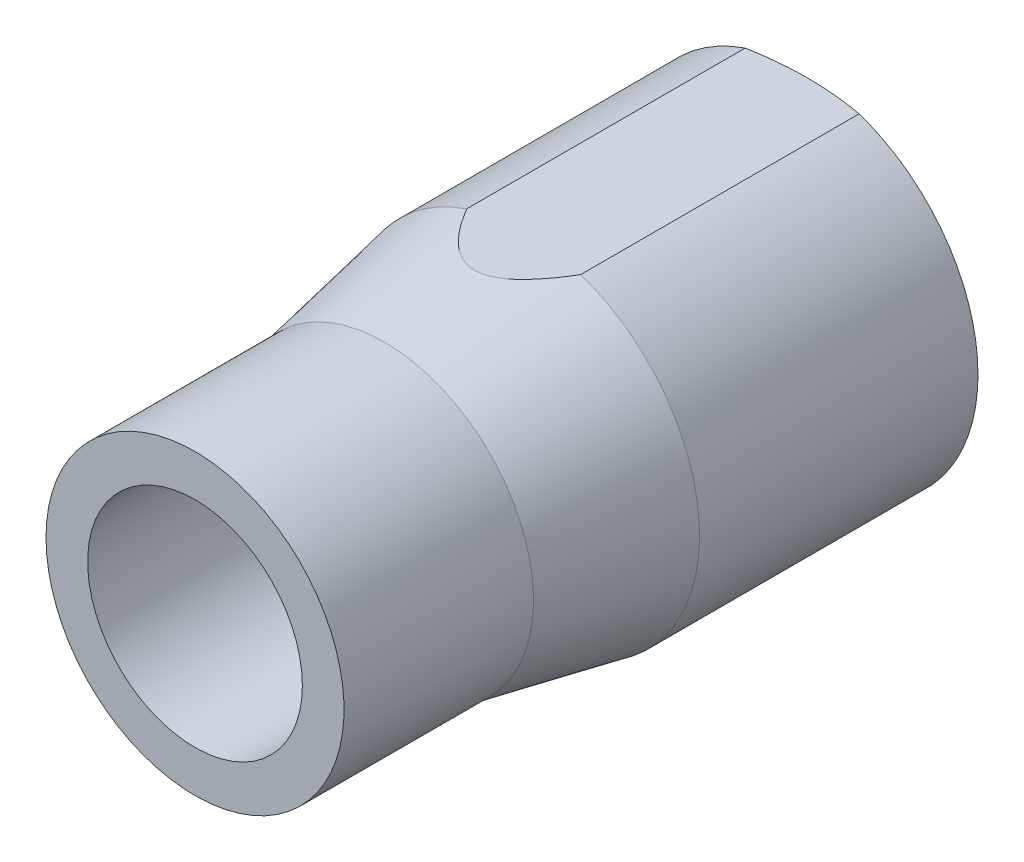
ISO-10303-21;
HEADER;
FILE_DESCRIPTION(('STEP AP214'),'2;1');
FILE_NAME('part.step','',(''),(''),'','','');
FILE_SCHEMA(('AUTOMOTIVE_DESIGN { 1 0 10303 214 1 1 1 1 }'));
ENDSEC;
DATA;
#1=APPLICATION_CONTEXT('core data for automotive mechanical design processes');
#2=APPLICATION_PROTOCOL_DEFINITION('international standard','automotive_design',2000,#1);
#3=PRODUCT_CONTEXT('',#1,'mechanical');
#4=PRODUCT('Part','Part','',(#3));
#5=PRODUCT_RELATED_PRODUCT_CATEGORY('part','',(#4));
#6=PRODUCT_DEFINITION_FORMATION('','',#4);
#7=PRODUCT_DEFINITION_CONTEXT('part definition',#1,'design');
#8=PRODUCT_DEFINITION('design','',#6,#7);
#9=PRODUCT_DEFINITION_SHAPE('','',#8);
#10=(LENGTH_UNIT() NAMED_UNIT(*) SI_UNIT(.MILLI.,.METRE.));
#11=(NAMED_UNIT(*) PLANE_ANGLE_UNIT() SI_UNIT($,.RADIAN.));
#12=(NAMED_UNIT(*) SI_UNIT($,.STERADIAN.) SOLID_ANGLE_UNIT());
#13=UNCERTAINTY_MEASURE_WITH_UNIT(LENGTH_MEASURE(1.E-05),#10,'distance_accuracy_value','');
#14=(GEOMETRIC_REPRESENTATION_CONTEXT(3) GLOBAL_UNCERTAINTY_ASSIGNED_CONTEXT((#13)) GLOBAL_UNIT_ASSIGNED_CONTEXT((#10,
#11,#12)) REPRESENTATION_CONTEXT('',''));
#15=CARTESIAN_POINT('',(0.,0.,0.));
#16=DIRECTION('',(0.,0.,1.));
#17=DIRECTION('',(1.,0.,0.));
#18=AXIS2_PLACEMENT_3D('',#15,#16,#17);
#19=CARTESIAN_POINT('',(0.,0.,13.7795));
#20=DIRECTION('',(0.,0.,-1.));
#21=DIRECTION('',(-1.,0.,0.));
#22=AXIS2_PLACEMENT_3D('',#19,#20,#21);
#23=CYLINDRICAL_SURFACE('',#22,2.06985324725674);
#24=CARTESIAN_POINT('',(0.,0.,0.));
#25=DIRECTION('',(0.,0.,-1.));
#26=DIRECTION('',(-1.,0.,0.));
#27=AXIS2_PLACEMENT_3D('',#24,#25,#26);
#28=CIRCLE('',#27,2.06985324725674);
#29=CARTESIAN_POINT('',(-2.06985324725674,0.,0.));
#30=VERTEX_POINT('',#29);
#31=EDGE_CURVE('E170',#30,#30,#28,.T.);
#32=ORIENTED_EDGE('',*,*,#31,.T.);
#33=EDGE_LOOP('',(#32));
#34=FACE_BOUND('',#33,.T.);
#35=CARTESIAN_POINT('',(0.,0.,11.3284));
#36=DIRECTION('',(0.,0.,1.));
#37=DIRECTION('',(1.,0.,0.));
#38=AXIS2_PLACEMENT_3D('',#35,#36,#37);
#39=CIRCLE('',#38,2.06985324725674);
#40=CARTESIAN_POINT('',(2.06985324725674,0.,11.3284));
#41=VERTEX_POINT('',#40);
#42=EDGE_CURVE('E42',#41,#41,#39,.F.);
#43=ORIENTED_EDGE('',*,*,#42,.F.);
#44=EDGE_LOOP('',(#43));
#45=FACE_BOUND('',#44,.T.);
#46=ADVANCED_FACE('F37',(#34,#45),#23,.F.);
#47=CARTESIAN_POINT('',(0.,0.,9.7155));
#48=DIRECTION('',(0.,0.,-1.));
#49=DIRECTION('',(-1.,0.,0.));
#50=AXIS2_PLACEMENT_3D('',#47,#48,#49);
#51=CYLINDRICAL_SURFACE('',#50,5.2451);
#52=DIRECTION('',(0.,0.,-1.));
#53=VECTOR('',#52,1.);
#54=CARTESIAN_POINT('',(1.69954716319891,4.96211783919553,9.7155));
#55=LINE('',#54,#53);
#56=CARTESIAN_POINT('',(1.69954716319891,4.96211783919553,9.7155));
#57=VERTEX_POINT('',#56);
#58=CARTESIAN_POINT('',(1.69954716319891,4.96211783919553,1.40794499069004));
#59=VERTEX_POINT('',#58);
#60=EDGE_CURVE('E162',#57,#59,#55,.T.);
#61=ORIENTED_EDGE('',*,*,#60,.F.);
#62=CARTESIAN_POINT('',(0.,0.,9.7155));
#63=DIRECTION('',(0.,0.,-1.));
#64=DIRECTION('',(-1.,0.,0.));
#65=AXIS2_PLACEMENT_3D('',#62,#63,#64);
#66=CIRCLE('',#65,5.2451);
#67=CARTESIAN_POINT('',(1.69954716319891,-4.96211783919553,9.7155));
#68=VERTEX_POINT('',#67);
#69=EDGE_CURVE('E97',#68,#57,#66,.F.);
#70=ORIENTED_EDGE('',*,*,#69,.F.);
#71=DIRECTION('',(0.,0.,-1.));
#72=VECTOR('',#71,1.);
#73=CARTESIAN_POINT('',(1.69954716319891,-4.96211783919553,9.7155));
#74=LINE('',#73,#72);
#75=CARTESIAN_POINT('',(1.69954716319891,-4.96211783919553,1.40794499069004));
#76=VERTEX_POINT('',#75);
#77=EDGE_CURVE('E54',#76,#68,#74,.F.);
#78=ORIENTED_EDGE('',*,*,#77,.F.);
#79=CARTESIAN_POINT('',(0.,0.,1.40794499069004));
#80=DIRECTION('',(0.,0.,1.));
#81=DIRECTION('',(1.,0.,0.));
#82=AXIS2_PLACEMENT_3D('',#79,#80,#81);
#83=CIRCLE('',#82,5.2451);
#84=EDGE_CURVE('E96',#76,#59,#83,.T.);
#85=ORIENTED_EDGE('',*,*,#84,.T.);
#86=EDGE_LOOP('',(#61,#70,#78,#85));
#87=FACE_BOUND('',#86,.T.);
#88=ADVANCED_FACE('F183',(#87),#51,.T.);
#89=DIRECTION('',(0.,0.,-1.));
#90=VECTOR('',#89,1.);
#91=CARTESIAN_POINT('',(-1.69954716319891,4.96211783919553,9.7155));
#92=LINE('',#91,#90);
#93=CARTESIAN_POINT('',(-1.69954716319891,4.96211783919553,1.40794499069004));
#94=VERTEX_POINT('',#93);
#95=CARTESIAN_POINT('',(-1.69954716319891,4.96211783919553,9.7155));
#96=VERTEX_POINT('',#95);
#97=EDGE_CURVE('E62',#94,#96,#92,.F.);
#98=ORIENTED_EDGE('',*,*,#97,.F.);
#99=CARTESIAN_POINT('',(-1.69954716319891,-4.96211783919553,1.40794499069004));
#100=VERTEX_POINT('',#99);
#101=EDGE_CURVE('E92',#94,#100,#83,.T.);
#102=ORIENTED_EDGE('',*,*,#101,.T.);
#103=DIRECTION('',(0.,0.,-1.));
#104=VECTOR('',#103,1.);
#105=CARTESIAN_POINT('',(-1.69954716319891,-4.96211783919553,9.7155));
#106=LINE('',#105,#104);
#107=CARTESIAN_POINT('',(-1.69954716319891,-4.96211783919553,9.7155));
#108=VERTEX_POINT('',#107);
#109=EDGE_CURVE('E78',#108,#100,#106,.T.);
#110=ORIENTED_EDGE('',*,*,#109,.F.);
#111=EDGE_CURVE('E90',#96,#108,#66,.F.);
#112=ORIENTED_EDGE('',*,*,#111,.F.);
#113=EDGE_LOOP('',(#98,#102,#110,#112));
#114=FACE_BOUND('',#113,.T.);
#115=ADVANCED_FACE('F89',(#114),#51,.T.);
#116=CARTESIAN_POINT('',(0.,0.,1.40794499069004));
#117=DIRECTION('',(0.,0.,1.));
#118=DIRECTION('',(1.,0.,0.));
#119=AXIS2_PLACEMENT_3D('',#116,#117,#118);
#120=CONICAL_SURFACE('',#119,5.2451,1.06465084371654);
#121=CARTESIAN_POINT('',(0.,0.,0.));
#122=DIRECTION('',(0.,0.,1.));
#123=DIRECTION('',(1.,0.,0.));
#124=AXIS2_PLACEMENT_3D('',#121,#122,#123);
#125=CIRCLE('',#124,2.70509999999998);
#126=CARTESIAN_POINT('',(2.70509999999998,0.,0.));
#127=VERTEX_POINT('',#126);
#128=EDGE_CURVE('E84',#127,#127,#125,.F.);
#129=ORIENTED_EDGE('',*,*,#128,.F.);
#130=EDGE_LOOP('',(#129));
#131=FACE_BOUND('',#130,.T.);
#132=ORIENTED_EDGE('',*,*,#101,.F.);
#133=CARTESIAN_POINT('',(-7.09579786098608,4.96211783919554,3.30013036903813));
#134=CARTESIAN_POINT('',(-6.88559882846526,4.96211783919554,3.20467618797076));
#135=CARTESIAN_POINT('',(-6.6748884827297,4.96211783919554,3.110325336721));
#136=CARTESIAN_POINT('',(-6.25217843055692,4.96211783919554,2.92445065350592));
#137=CARTESIAN_POINT('',(-6.04017848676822,4.96211783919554,2.832927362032));
#138=CARTESIAN_POINT('',(-5.61342540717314,4.96211783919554,2.65282607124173));
#139=CARTESIAN_POINT('',(-5.39866338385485,4.96211783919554,2.56426904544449));
#140=CARTESIAN_POINT('',(-4.96737319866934,4.96211783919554,2.39158081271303));
#141=CARTESIAN_POINT('',(-4.7508451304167,4.96211783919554,2.30744937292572));
#142=CARTESIAN_POINT('',(-4.31194202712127,4.96211783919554,2.14335496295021));
#143=CARTESIAN_POINT('',(-4.08953054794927,4.96211783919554,2.06348886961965));
#144=CARTESIAN_POINT('',(-3.64216471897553,4.96211783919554,1.91108621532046));
#145=CARTESIAN_POINT('',(-3.41721011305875,4.96211783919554,1.83855040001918));
#146=CARTESIAN_POINT('',(-2.96499915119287,4.96211783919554,1.70297541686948));
#147=CARTESIAN_POINT('',(-2.73774940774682,4.96211783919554,1.63991443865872));
#148=CARTESIAN_POINT('',(-2.28033075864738,4.96211783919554,1.52550762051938));
#149=CARTESIAN_POINT('',(-2.05016251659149,4.96211783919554,1.47415916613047));
#150=CARTESIAN_POINT('',(-1.58327907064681,4.96211783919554,1.38511090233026));
#151=CARTESIAN_POINT('',(-1.3465182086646,4.96211783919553,1.34764563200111));
#152=CARTESIAN_POINT('',(-0.870837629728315,4.96211783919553,1.2901610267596));
#153=CARTESIAN_POINT('',(-0.631917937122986,4.96211783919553,1.27014149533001));
#154=CARTESIAN_POINT('',(-0.155585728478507,4.96211783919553,1.24932127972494));
#155=CARTESIAN_POINT('',(0.0818183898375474,4.96211783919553,1.24833286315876));
#156=CARTESIAN_POINT('',(0.555961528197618,4.96211783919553,1.26518595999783));
#157=CARTESIAN_POINT('',(0.792700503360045,4.96211783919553,1.2830287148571));
#158=CARTESIAN_POINT('',(1.22065762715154,4.96211783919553,1.33115772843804));
#159=CARTESIAN_POINT('',(1.41221476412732,4.96211783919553,1.35854035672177));
#160=CARTESIAN_POINT('',(1.79361048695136,4.96211783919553,1.42352499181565));
#161=CARTESIAN_POINT('',(1.98344871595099,4.96211783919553,1.46112907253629));
#162=CARTESIAN_POINT('',(2.36133958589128,4.96211783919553,1.54512982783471));
#163=CARTESIAN_POINT('',(2.54939030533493,4.96211783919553,1.59153503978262));
#164=CARTESIAN_POINT('',(2.9235041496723,4.96211783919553,1.69167672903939));
#165=CARTESIAN_POINT('',(3.10956734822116,4.96211783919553,1.745412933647));
#166=CARTESIAN_POINT('',(3.4840699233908,4.96211783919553,1.86023956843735));
#167=CARTESIAN_POINT('',(3.67246595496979,4.96211783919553,1.92147037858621));
#168=CARTESIAN_POINT('',(4.04748794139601,4.96211783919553,2.04910671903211));
#169=CARTESIAN_POINT('',(4.23411388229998,4.96211783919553,2.11551229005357));
#170=CARTESIAN_POINT('',(4.6057094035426,4.96211783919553,2.2525163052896));
#171=CARTESIAN_POINT('',(4.79067975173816,4.96211783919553,2.32311267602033));
#172=CARTESIAN_POINT('',(5.15925222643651,4.96211783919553,2.46776408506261));
#173=CARTESIAN_POINT('',(5.34285439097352,4.96211783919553,2.54181902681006));
#174=CARTESIAN_POINT('',(5.72521900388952,4.96211783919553,2.69951629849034));
#175=CARTESIAN_POINT('',(5.92387162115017,4.96211783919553,2.7834243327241));
#176=CARTESIAN_POINT('',(6.31998912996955,4.96211783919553,2.95400277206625));
#177=CARTESIAN_POINT('',(6.51745399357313,4.96211783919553,3.04067324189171));
#178=CARTESIAN_POINT('',(7.10837754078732,4.96211783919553,3.30408419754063));
#179=CARTESIAN_POINT('',(7.50032726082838,4.96211783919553,3.48420835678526));
#180=CARTESIAN_POINT('',(8.28142867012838,4.96211783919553,3.8507457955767));
#181=CARTESIAN_POINT('',(8.67057928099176,4.96211783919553,4.03716135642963));
#182=CARTESIAN_POINT('',(9.44670570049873,4.96211783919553,4.4144767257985));
#183=CARTESIAN_POINT('',(9.83368146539,4.96211783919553,4.60537662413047));
#184=CARTESIAN_POINT('',(10.6065478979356,4.96211783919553,4.99076138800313));
#185=CARTESIAN_POINT('',(10.9924361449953,4.96211783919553,5.18525109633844));
#186=CARTESIAN_POINT('',(11.7629421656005,4.96211783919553,5.57673885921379));
#187=CARTESIAN_POINT('',(12.1475599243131,4.96211783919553,5.77373694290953));
#188=CARTESIAN_POINT('',(12.9157069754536,4.96211783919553,6.16962264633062));
#189=CARTESIAN_POINT('',(13.2992365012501,4.96211783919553,6.36850981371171));
#190=CARTESIAN_POINT('',(14.0655000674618,4.96211783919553,6.76781033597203));
#191=CARTESIAN_POINT('',(14.4482341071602,4.96211783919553,6.96822369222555));
#192=CARTESIAN_POINT('',(15.4996129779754,4.96211783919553,7.52089149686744));
#193=CARTESIAN_POINT('',(16.1676004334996,4.96211783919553,7.87439617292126));
#194=CARTESIAN_POINT('',(17.5022402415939,4.96211783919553,8.58402327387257));
#195=CARTESIAN_POINT('',(18.1688924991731,4.96211783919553,8.94014587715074));
#196=CARTESIAN_POINT('',(19.4993845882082,4.96211783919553,9.65331131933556));
#197=CARTESIAN_POINT('',(20.1632271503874,4.96211783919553,10.0103490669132));
#198=CARTESIAN_POINT('',(21.490088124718,4.96211783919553,10.7258321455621));
#199=CARTESIAN_POINT('',(22.1531065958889,4.96211783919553,11.0842773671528));
#200=CARTESIAN_POINT('',(22.8158545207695,4.96211783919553,11.4432196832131));
#201=B_SPLINE_CURVE_WITH_KNOTS('',3,(#133,#134,#135,#136,#137,#138,#139,#140,#141,#142,#143,
#144,#145,#146,#147,#148,#149,#150,#151,#152,#153,#154,#155,#156,#157,#158,#159,#160,#161,#162,
#163,#164,#165,#166,#167,#168,#169,#170,#171,#172,#173,#174,#175,#176,#177,#178,#179,#180,#181,
#182,#183,#184,#185,#186,#187,#188,#189,#190,#191,#192,#193,#194,#195,#196,#197,#198,#199,#200),
.UNSPECIFIED.,.F.,.F.,(4,2,2,2,2,2,2,2,2,2,2,2,2,2,2,2,2,2,2,2,2,2,2,2,2,2,2,2,2,2,2,2,2,4),(0.,
0.692582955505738,1.38529749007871,2.08216949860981,2.77900480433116,3.48785425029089,
4.19677573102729,4.90403946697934,5.6111451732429,6.32970392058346,7.04825457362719,
7.7597134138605,8.47121916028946,9.05143593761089,9.63177052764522,10.2126709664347,
10.7935498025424,11.38774833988,11.9819515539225,12.5758631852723,13.169758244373,
13.8166716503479,14.4636002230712,15.757580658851,17.0520354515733,18.3465161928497,
19.6428935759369,20.9392860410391,22.235375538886,23.5314662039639,25.7987361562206,
28.06616205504,30.3274574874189,32.5885803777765),.UNSPECIFIED.);
#202=EDGE_CURVE('E164',#94,#59,#201,.T.);
#203=ORIENTED_EDGE('',*,*,#202,.T.);
#204=ORIENTED_EDGE('',*,*,#84,.F.);
#205=CARTESIAN_POINT('',(-7.09579786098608,-4.96211783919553,3.30013036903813));
#206=CARTESIAN_POINT('',(-6.88559882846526,-4.96211783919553,3.20467618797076));
#207=CARTESIAN_POINT('',(-6.6748884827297,-4.96211783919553,3.110325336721));
#208=CARTESIAN_POINT('',(-6.25217843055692,-4.96211783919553,2.92445065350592));
#209=CARTESIAN_POINT('',(-6.04017848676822,-4.96211783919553,2.832927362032));
#210=CARTESIAN_POINT('',(-5.61342540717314,-4.96211783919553,2.65282607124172));
#211=CARTESIAN_POINT('',(-5.39866338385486,-4.96211783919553,2.56426904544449));
#212=CARTESIAN_POINT('',(-4.96737319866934,-4.96211783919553,2.39158081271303));
#213=CARTESIAN_POINT('',(-4.7508451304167,-4.96211783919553,2.30744937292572));
#214=CARTESIAN_POINT('',(-4.31194202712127,-4.96211783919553,2.14335496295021));
#215=CARTESIAN_POINT('',(-4.08953054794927,-4.96211783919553,2.06348886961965));
#216=CARTESIAN_POINT('',(-3.64216471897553,-4.96211783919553,1.91108621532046));
#217=CARTESIAN_POINT('',(-3.41721011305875,-4.96211783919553,1.83855040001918));
#218=CARTESIAN_POINT('',(-2.96499915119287,-4.96211783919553,1.70297541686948));
#219=CARTESIAN_POINT('',(-2.73774940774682,-4.96211783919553,1.63991443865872));
#220=CARTESIAN_POINT('',(-2.28033075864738,-4.96211783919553,1.52550762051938));
#221=CARTESIAN_POINT('',(-2.05016251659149,-4.96211783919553,1.47415916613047));
#222=CARTESIAN_POINT('',(-1.58327907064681,-4.96211783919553,1.38511090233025));
#223=CARTESIAN_POINT('',(-1.3465182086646,-4.96211783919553,1.34764563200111));
#224=CARTESIAN_POINT('',(-0.870837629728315,-4.96211783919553,1.2901610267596));
#225=CARTESIAN_POINT('',(-0.631917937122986,-4.96211783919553,1.27014149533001));
#226=CARTESIAN_POINT('',(-0.155585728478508,-4.96211783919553,1.24932127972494));
#227=CARTESIAN_POINT('',(0.081818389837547,-4.96211783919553,1.24833286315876));
#228=CARTESIAN_POINT('',(0.555961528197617,-4.96211783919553,1.26518595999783));
#229=CARTESIAN_POINT('',(0.792700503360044,-4.96211783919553,1.2830287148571));
#230=CARTESIAN_POINT('',(1.22065762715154,-4.96211783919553,1.33115772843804));
#231=CARTESIAN_POINT('',(1.41221476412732,-4.96211783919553,1.35854035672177));
#232=CARTESIAN_POINT('',(1.79361048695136,-4.96211783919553,1.42352499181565));
#233=CARTESIAN_POINT('',(1.98344871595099,-4.96211783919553,1.46112907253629));
#234=CARTESIAN_POINT('',(2.36133958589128,-4.96211783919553,1.54512982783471));
#235=CARTESIAN_POINT('',(2.54939030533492,-4.96211783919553,1.59153503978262));
#236=CARTESIAN_POINT('',(2.9235041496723,-4.96211783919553,1.69167672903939));
#237=CARTESIAN_POINT('',(3.10956734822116,-4.96211783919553,1.745412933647));
#238=CARTESIAN_POINT('',(3.4840699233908,-4.96211783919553,1.86023956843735));
#239=CARTESIAN_POINT('',(3.67246595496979,-4.96211783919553,1.92147037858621));
#240=CARTESIAN_POINT('',(4.04748794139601,-4.96211783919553,2.04910671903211));
#241=CARTESIAN_POINT('',(4.23411388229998,-4.96211783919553,2.11551229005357));
#242=CARTESIAN_POINT('',(4.6057094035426,-4.96211783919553,2.2525163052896));
#243=CARTESIAN_POINT('',(4.79067975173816,-4.96211783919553,2.32311267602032));
#244=CARTESIAN_POINT('',(5.15925222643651,-4.96211783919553,2.46776408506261));
#245=CARTESIAN_POINT('',(5.34285439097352,-4.96211783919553,2.54181902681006));
#246=CARTESIAN_POINT('',(5.72521900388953,-4.96211783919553,2.69951629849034));
#247=CARTESIAN_POINT('',(5.92387162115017,-4.96211783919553,2.7834243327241));
#248=CARTESIAN_POINT('',(6.31998912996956,-4.96211783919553,2.95400277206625));
#249=CARTESIAN_POINT('',(6.51745399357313,-4.96211783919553,3.04067324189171));
#250=CARTESIAN_POINT('',(7.10837754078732,-4.96211783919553,3.30408419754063));
#251=CARTESIAN_POINT('',(7.50032726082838,-4.96211783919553,3.48420835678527));
#252=CARTESIAN_POINT('',(8.28142867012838,-4.96211783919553,3.8507457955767));
#253=CARTESIAN_POINT('',(8.67057928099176,-4.96211783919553,4.03716135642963));
#254=CARTESIAN_POINT('',(9.44670570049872,-4.96211783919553,4.4144767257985));
#255=CARTESIAN_POINT('',(9.83368146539,-4.96211783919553,4.60537662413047));
#256=CARTESIAN_POINT('',(10.6065478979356,-4.96211783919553,4.99076138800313));
#257=CARTESIAN_POINT('',(10.9924361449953,-4.96211783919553,5.18525109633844));
#258=CARTESIAN_POINT('',(11.7629421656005,-4.96211783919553,5.57673885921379));
#259=CARTESIAN_POINT('',(12.1475599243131,-4.96211783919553,5.77373694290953));
#260=CARTESIAN_POINT('',(12.9157069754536,-4.96211783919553,6.16962264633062));
#261=CARTESIAN_POINT('',(13.2992365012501,-4.96211783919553,6.36850981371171));
#262=CARTESIAN_POINT('',(14.0655000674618,-4.96211783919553,6.76781033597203));
#263=CARTESIAN_POINT('',(14.4482341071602,-4.96211783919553,6.96822369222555));
#264=CARTESIAN_POINT('',(15.4996129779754,-4.96211783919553,7.52089149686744));
#265=CARTESIAN_POINT('',(16.1676004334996,-4.96211783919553,7.87439617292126));
#266=CARTESIAN_POINT('',(17.5022402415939,-4.96211783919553,8.58402327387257));
#267=CARTESIAN_POINT('',(18.1688924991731,-4.96211783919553,8.94014587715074));
#268=CARTESIAN_POINT('',(19.4993845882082,-4.96211783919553,9.65331131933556));
#269=CARTESIAN_POINT('',(20.1632271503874,-4.96211783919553,10.0103490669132));
#270=CARTESIAN_POINT('',(21.490088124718,-4.96211783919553,10.7258321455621));
#271=CARTESIAN_POINT('',(22.1531065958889,-4.96211783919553,11.0842773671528));
#272=CARTESIAN_POINT('',(22.8158545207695,-4.96211783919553,11.4432196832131));
#273=B_SPLINE_CURVE_WITH_KNOTS('',3,(#205,#206,#207,#208,#209,#210,#211,#212,#213,#214,#215,
#216,#217,#218,#219,#220,#221,#222,#223,#224,#225,#226,#227,#228,#229,#230,#231,#232,#233,#234,
#235,#236,#237,#238,#239,#240,#241,#242,#243,#244,#245,#246,#247,#248,#249,#250,#251,#252,#253,
#254,#255,#256,#257,#258,#259,#260,#261,#262,#263,#264,#265,#266,#267,#268,#269,#270,#271,#272),
.UNSPECIFIED.,.F.,.F.,(4,2,2,2,2,2,2,2,2,2,2,2,2,2,2,2,2,2,2,2,2,2,2,2,2,2,2,2,2,2,2,2,2,4),(0.,
0.692582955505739,1.38529749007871,2.08216949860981,2.77900480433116,3.48785425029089,
4.19677573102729,4.90403946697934,5.6111451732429,6.32970392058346,7.04825457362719,
7.7597134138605,8.47121916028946,9.05143593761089,9.63177052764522,10.2126709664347,
10.7935498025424,11.38774833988,11.9819515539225,12.5758631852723,13.169758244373,
13.8166716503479,14.4636002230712,15.757580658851,17.0520354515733,18.3465161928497,
19.6428935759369,20.9392860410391,22.235375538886,23.5314662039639,25.7987361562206,
28.06616205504,30.3274574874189,32.5885803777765),.UNSPECIFIED.);
#274=EDGE_CURVE('E93',#76,#100,#273,.F.);
#275=ORIENTED_EDGE('',*,*,#274,.T.);
#276=EDGE_LOOP('',(#132,#203,#204,#275));
#277=FACE_BOUND('',#276,.T.);
#278=ADVANCED_FACE('F39',(#131,#277),#120,.T.);
#279=CARTESIAN_POINT('',(0.,0.,13.8684));
#280=DIRECTION('',(0.,0.,-1.));
#281=DIRECTION('',(-1.,0.,0.));
#282=AXIS2_PLACEMENT_3D('',#279,#280,#281);
#283=CONICAL_SURFACE('',#282,4.445,0.190328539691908);
#284=CARTESIAN_POINT('',(0.,0.,13.8684));
#285=DIRECTION('',(0.,0.,1.));
#286=DIRECTION('',(1.,0.,0.));
#287=AXIS2_PLACEMENT_3D('',#284,#285,#286);
#288=CIRCLE('',#287,4.445);
#289=CARTESIAN_POINT('',(-4.445,0.,13.8684));
#290=VERTEX_POINT('',#289);
#291=EDGE_CURVE('E101',#290,#290,#288,.T.);
#292=ORIENTED_EDGE('',*,*,#291,.F.);
#293=EDGE_LOOP('',(#292));
#294=FACE_BOUND('',#293,.T.);
#295=ORIENTED_EDGE('',*,*,#69,.T.);
#296=CARTESIAN_POINT('',(-5.30348319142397,4.96211783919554,-0.757782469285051));
#297=CARTESIAN_POINT('',(-5.21528122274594,4.96211783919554,-0.423539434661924));
#298=CARTESIAN_POINT('',(-5.12614594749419,4.96211783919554,-0.0895399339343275));
#299=CARTESIAN_POINT('',(-4.94563650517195,4.96211783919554,0.577871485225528));
#300=CARTESIAN_POINT('',(-4.85426222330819,4.96211783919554,0.911283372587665));
#301=CARTESIAN_POINT('',(-4.66861932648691,4.96211783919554,1.57843459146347));
#302=CARTESIAN_POINT('',(-4.57434249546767,4.96211783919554,1.91217164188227));
#303=CARTESIAN_POINT('',(-4.38267078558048,4.96211783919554,2.57874131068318));
#304=CARTESIAN_POINT('',(-4.28527598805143,4.96211783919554,2.91157395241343));
#305=CARTESIAN_POINT('',(-4.07604184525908,4.96211783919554,3.61185147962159));
#306=CARTESIAN_POINT('',(-3.96377551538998,4.96211783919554,3.97916925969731));
#307=CARTESIAN_POINT('',(-3.73340292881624,4.96211783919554,4.71201119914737));
#308=CARTESIAN_POINT('',(-3.61529618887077,4.96211783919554,5.07753520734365));
#309=CARTESIAN_POINT('',(-3.37173346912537,4.96211783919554,5.80530358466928));
#310=CARTESIAN_POINT('',(-3.24629314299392,4.96211783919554,6.16755316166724));
#311=CARTESIAN_POINT('',(-2.98518534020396,4.96211783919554,6.88830923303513));
#312=CARTESIAN_POINT('',(-2.84951989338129,4.96211783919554,7.24681645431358));
#313=CARTESIAN_POINT('',(-2.59989904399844,4.96211783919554,7.867223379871));
#314=CARTESIAN_POINT('',(-2.48923720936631,4.96211783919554,8.13043156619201));
#315=CARTESIAN_POINT('',(-2.31443035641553,4.96211783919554,8.52181678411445));
#316=CARTESIAN_POINT('',(-2.25458926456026,4.96211783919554,8.65191330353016));
#317=CARTESIAN_POINT('',(-2.13138889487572,4.96211783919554,8.91041524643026));
#318=CARTESIAN_POINT('',(-2.06803015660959,4.96211783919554,9.03882092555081));
#319=CARTESIAN_POINT('',(-1.93845383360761,4.96211783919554,9.2905174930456));
#320=CARTESIAN_POINT('',(-1.87233377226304,4.96211783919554,9.41385832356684));
#321=CARTESIAN_POINT('',(-1.73487780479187,4.96211783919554,9.65759186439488));
#322=CARTESIAN_POINT('',(-1.66354317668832,4.96211783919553,9.7779852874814));
#323=CARTESIAN_POINT('',(-1.51444282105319,4.96211783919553,10.013986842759));
#324=CARTESIAN_POINT('',(-1.43670781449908,4.96211783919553,10.1296142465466));
#325=CARTESIAN_POINT('',(-1.27234807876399,4.96211783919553,10.3543072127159));
#326=CARTESIAN_POINT('',(-1.18573798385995,4.96211783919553,10.4633831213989));
#327=CARTESIAN_POINT('',(-1.06102506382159,4.96211783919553,10.6025898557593));
#328=CARTESIAN_POINT('',(-1.02835758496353,4.96211783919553,10.6375844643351));
#329=CARTESIAN_POINT('',(-0.961355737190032,4.96211783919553,10.7059516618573));
#330=CARTESIAN_POINT('',(-0.927020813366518,4.96211783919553,10.7393237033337));
#331=CARTESIAN_POINT('',(-0.821277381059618,4.96211783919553,10.8364190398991));
#332=CARTESIAN_POINT('',(-0.747047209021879,4.96211783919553,10.8972171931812));
#333=CARTESIAN_POINT('',(-0.610564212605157,4.96211783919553,10.9917714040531));
#334=CARTESIAN_POINT('',(-0.550344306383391,4.96211783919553,11.0284251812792));
#335=CARTESIAN_POINT('',(-0.42493201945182,4.96211783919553,11.0920626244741));
#336=CARTESIAN_POINT('',(-0.359748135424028,4.96211783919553,11.1190623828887));
#337=CARTESIAN_POINT('',(-0.2392793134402,4.96211783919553,11.1558611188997));
#338=CARTESIAN_POINT('',(-0.184740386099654,4.96211783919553,11.1680644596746));
#339=CARTESIAN_POINT('',(-0.0743925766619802,4.96211783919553,11.1830028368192));
#340=CARTESIAN_POINT('',(-0.0185850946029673,4.96211783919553,11.1857478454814));
#341=CARTESIAN_POINT('',(0.0926578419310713,4.96211783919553,11.1814416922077));
#342=CARTESIAN_POINT('',(0.148093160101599,4.96211783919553,11.1743871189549));
#343=CARTESIAN_POINT('',(0.257059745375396,4.96211783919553,11.1513293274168));
#344=CARTESIAN_POINT('',(0.310589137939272,4.96211783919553,11.1353175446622));
#345=CARTESIAN_POINT('',(0.437296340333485,4.96211783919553,11.0873772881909));
#346=CARTESIAN_POINT('',(0.508984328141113,4.96211783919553,11.0515619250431));
#347=CARTESIAN_POINT('',(0.646018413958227,4.96211783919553,10.96937984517));
#348=CARTESIAN_POINT('',(0.711345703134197,4.96211783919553,10.922983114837));
#349=CARTESIAN_POINT('',(0.833919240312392,4.96211783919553,10.8249489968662));
#350=CARTESIAN_POINT('',(0.891374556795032,4.96211783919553,10.7735677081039));
#351=CARTESIAN_POINT('',(1.00181003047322,4.96211783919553,10.66615905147));
#352=CARTESIAN_POINT('',(1.0547855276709,4.96211783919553,10.6101269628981));
#353=CARTESIAN_POINT('',(1.15739008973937,4.96211783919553,10.494278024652));
#354=CARTESIAN_POINT('',(1.20698772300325,4.96211783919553,10.4344336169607));
#355=CARTESIAN_POINT('',(1.30295612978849,4.96211783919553,10.3122899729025));
#356=CARTESIAN_POINT('',(1.349328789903,4.96211783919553,10.2499922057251));
#357=CARTESIAN_POINT('',(1.48490166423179,4.96211783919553,10.0596608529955));
#358=CARTESIAN_POINT('',(1.57007160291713,4.96211783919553,9.92876200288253));
#359=CARTESIAN_POINT('',(1.73267973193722,4.96211783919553,9.66221089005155));
#360=CARTESIAN_POINT('',(1.810111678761,4.96211783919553,9.52655490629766));
#361=CARTESIAN_POINT('',(1.95933064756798,4.96211783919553,9.25155818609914));
#362=CARTESIAN_POINT('',(2.0310963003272,4.96211783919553,9.11220592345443));
#363=CARTESIAN_POINT('',(2.16997350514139,4.96211783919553,8.83119805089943));
#364=CARTESIAN_POINT('',(2.23708447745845,4.96211783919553,8.68954215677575));
#365=CARTESIAN_POINT('',(2.3623452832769,4.96211783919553,8.41589541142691));
#366=CARTESIAN_POINT('',(2.42078281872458,4.96211783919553,8.28403559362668));
#367=CARTESIAN_POINT('',(2.53500768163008,4.96211783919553,8.0191597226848));
#368=CARTESIAN_POINT('',(2.59079472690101,4.96211783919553,7.88614354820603));
#369=CARTESIAN_POINT('',(2.69965196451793,4.96211783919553,7.62033366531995));
#370=CARTESIAN_POINT('',(2.75274130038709,4.96211783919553,7.48754777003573));
#371=CARTESIAN_POINT('',(2.85699298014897,4.96211783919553,7.22125431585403));
#372=CARTESIAN_POINT('',(2.90815574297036,4.96211783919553,7.08774692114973));
#373=CARTESIAN_POINT('',(2.95850895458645,4.96211783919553,6.9539401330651));
#374=B_SPLINE_CURVE_WITH_KNOTS('',3,(#296,#297,#298,#299,#300,#301,#302,#303,#304,#305,#306,
#307,#308,#309,#310,#311,#312,#313,#314,#315,#316,#317,#318,#319,#320,#321,#322,#323,#324,#325,
#326,#327,#328,#329,#330,#331,#332,#333,#334,#335,#336,#337,#338,#339,#340,#341,#342,#343,#344,
#345,#346,#347,#348,#349,#350,#351,#352,#353,#354,#355,#356,#357,#358,#359,#360,#361,#362,#363,
#364,#365,#366,#367,#368,#369,#370,#371,#372,#373),.UNSPECIFIED.,.F.,.F.,(4,2,2,2,2,2,2,2,2,2,2,
2,2,2,2,2,2,2,2,2,2,2,2,2,2,2,2,2,2,2,2,2,2,2,2,2,2,2,4),(0.,1.03705705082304,2.0741673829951,
3.11454710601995,4.15489971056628,5.30713594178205,6.45946767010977,7.60942367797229,
8.7591520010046,9.61550637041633,10.0450641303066,10.4745561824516,10.894300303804,
11.3139418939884,11.7316751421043,12.1487303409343,12.2922955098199,12.4359087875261,
12.7227569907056,12.9336522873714,13.1441943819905,13.3111292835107,13.4778881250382,
13.6447050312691,13.8116817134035,14.0507173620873,14.2904396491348,14.5213287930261,
14.7524552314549,14.9855003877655,15.2184080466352,15.6864670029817,16.1549006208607,
16.6250239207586,17.0952056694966,17.5278584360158,17.9605571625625,18.3895581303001,
18.8184652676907),.UNSPECIFIED.);
#375=EDGE_CURVE('E13',#57,#96,#374,.F.);
#376=ORIENTED_EDGE('',*,*,#375,.T.);
#377=ORIENTED_EDGE('',*,*,#111,.T.);
#378=CARTESIAN_POINT('',(-5.30348319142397,-4.96211783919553,-0.757782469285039));
#379=CARTESIAN_POINT('',(-5.21528122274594,-4.96211783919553,-0.423539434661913));
#380=CARTESIAN_POINT('',(-5.12614594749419,-4.96211783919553,-0.0895399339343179));
#381=CARTESIAN_POINT('',(-4.94563650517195,-4.96211783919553,0.577871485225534));
#382=CARTESIAN_POINT('',(-4.85426222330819,-4.96211783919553,0.911283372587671));
#383=CARTESIAN_POINT('',(-4.66861932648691,-4.96211783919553,1.57843459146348));
#384=CARTESIAN_POINT('',(-4.57434249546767,-4.96211783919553,1.91217164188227));
#385=CARTESIAN_POINT('',(-4.38267078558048,-4.96211783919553,2.57874131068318));
#386=CARTESIAN_POINT('',(-4.28527598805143,-4.96211783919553,2.91157395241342));
#387=CARTESIAN_POINT('',(-4.07604184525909,-4.96211783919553,3.61185147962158));
#388=CARTESIAN_POINT('',(-3.96377551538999,-4.96211783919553,3.9791692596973));
#389=CARTESIAN_POINT('',(-3.73340292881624,-4.96211783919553,4.71201119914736));
#390=CARTESIAN_POINT('',(-3.61529618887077,-4.96211783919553,5.07753520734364));
#391=CARTESIAN_POINT('',(-3.37173346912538,-4.96211783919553,5.80530358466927));
#392=CARTESIAN_POINT('',(-3.24629314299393,-4.96211783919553,6.16755316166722));
#393=CARTESIAN_POINT('',(-2.98518534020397,-4.96211783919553,6.88830923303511));
#394=CARTESIAN_POINT('',(-2.8495198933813,-4.96211783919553,7.24681645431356));
#395=CARTESIAN_POINT('',(-2.59989904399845,-4.96211783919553,7.86722337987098));
#396=CARTESIAN_POINT('',(-2.48923720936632,-4.96211783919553,8.13043156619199));
#397=CARTESIAN_POINT('',(-2.31443035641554,-4.96211783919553,8.52181678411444));
#398=CARTESIAN_POINT('',(-2.25458926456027,-4.96211783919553,8.65191330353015));
#399=CARTESIAN_POINT('',(-2.13138889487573,-4.96211783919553,8.91041524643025));
#400=CARTESIAN_POINT('',(-2.0680301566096,-4.96211783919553,9.03882092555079));
#401=CARTESIAN_POINT('',(-1.93845383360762,-4.96211783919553,9.29051749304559));
#402=CARTESIAN_POINT('',(-1.87233377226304,-4.96211783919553,9.41385832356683));
#403=CARTESIAN_POINT('',(-1.73487780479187,-4.96211783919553,9.65759186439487));
#404=CARTESIAN_POINT('',(-1.66354317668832,-4.96211783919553,9.77798528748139));
#405=CARTESIAN_POINT('',(-1.51444282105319,-4.96211783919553,10.013986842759));
#406=CARTESIAN_POINT('',(-1.43670781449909,-4.96211783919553,10.1296142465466));
#407=CARTESIAN_POINT('',(-1.272348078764,-4.96211783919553,10.3543072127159));
#408=CARTESIAN_POINT('',(-1.18573798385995,-4.96211783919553,10.4633831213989));
#409=CARTESIAN_POINT('',(-1.06102506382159,-4.96211783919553,10.6025898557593));
#410=CARTESIAN_POINT('',(-1.02835758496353,-4.96211783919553,10.6375844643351));
#411=CARTESIAN_POINT('',(-0.961355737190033,-4.96211783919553,10.7059516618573));
#412=CARTESIAN_POINT('',(-0.927020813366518,-4.96211783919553,10.7393237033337));
#413=CARTESIAN_POINT('',(-0.821277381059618,-4.96211783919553,10.8364190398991));
#414=CARTESIAN_POINT('',(-0.747047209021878,-4.96211783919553,10.8972171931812));
#415=CARTESIAN_POINT('',(-0.610564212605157,-4.96211783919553,10.9917714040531));
#416=CARTESIAN_POINT('',(-0.550344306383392,-4.96211783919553,11.0284251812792));
#417=CARTESIAN_POINT('',(-0.424932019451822,-4.96211783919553,11.0920626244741));
#418=CARTESIAN_POINT('',(-0.359748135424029,-4.96211783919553,11.1190623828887));
#419=CARTESIAN_POINT('',(-0.2392793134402,-4.96211783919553,11.1558611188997));
#420=CARTESIAN_POINT('',(-0.184740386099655,-4.96211783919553,11.1680644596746));
#421=CARTESIAN_POINT('',(-0.0743925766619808,-4.96211783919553,11.1830028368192));
#422=CARTESIAN_POINT('',(-0.0185850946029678,-4.96211783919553,11.1857478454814));
#423=CARTESIAN_POINT('',(0.0926578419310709,-4.96211783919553,11.1814416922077));
#424=CARTESIAN_POINT('',(0.148093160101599,-4.96211783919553,11.1743871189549));
#425=CARTESIAN_POINT('',(0.257059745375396,-4.96211783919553,11.1513293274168));
#426=CARTESIAN_POINT('',(0.310589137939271,-4.96211783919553,11.1353175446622));
#427=CARTESIAN_POINT('',(0.437296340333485,-4.96211783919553,11.0873772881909));
#428=CARTESIAN_POINT('',(0.508984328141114,-4.96211783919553,11.0515619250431));
#429=CARTESIAN_POINT('',(0.646018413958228,-4.96211783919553,10.96937984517));
#430=CARTESIAN_POINT('',(0.711345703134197,-4.96211783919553,10.922983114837));
#431=CARTESIAN_POINT('',(0.833919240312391,-4.96211783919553,10.8249489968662));
#432=CARTESIAN_POINT('',(0.891374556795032,-4.96211783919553,10.7735677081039));
#433=CARTESIAN_POINT('',(1.00181003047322,-4.96211783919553,10.66615905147));
#434=CARTESIAN_POINT('',(1.0547855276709,-4.96211783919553,10.6101269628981));
#435=CARTESIAN_POINT('',(1.15739008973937,-4.96211783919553,10.494278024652));
#436=CARTESIAN_POINT('',(1.20698772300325,-4.96211783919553,10.4344336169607));
#437=CARTESIAN_POINT('',(1.30295612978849,-4.96211783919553,10.3122899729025));
#438=CARTESIAN_POINT('',(1.34932878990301,-4.96211783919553,10.2499922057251));
#439=CARTESIAN_POINT('',(1.4849016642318,-4.96211783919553,10.0596608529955));
#440=CARTESIAN_POINT('',(1.57007160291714,-4.96211783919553,9.92876200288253));
#441=CARTESIAN_POINT('',(1.73267973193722,-4.96211783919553,9.66221089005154));
#442=CARTESIAN_POINT('',(1.81011167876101,-4.96211783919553,9.52655490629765));
#443=CARTESIAN_POINT('',(1.95933064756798,-4.96211783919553,9.25155818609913));
#444=CARTESIAN_POINT('',(2.03109630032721,-4.96211783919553,9.11220592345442));
#445=CARTESIAN_POINT('',(2.16997350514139,-4.96211783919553,8.83119805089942));
#446=CARTESIAN_POINT('',(2.23708447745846,-4.96211783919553,8.68954215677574));
#447=CARTESIAN_POINT('',(2.3623452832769,-4.96211783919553,8.41589541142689));
#448=CARTESIAN_POINT('',(2.42078281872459,-4.96211783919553,8.28403559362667));
#449=CARTESIAN_POINT('',(2.53500768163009,-4.96211783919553,8.01915972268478));
#450=CARTESIAN_POINT('',(2.59079472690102,-4.96211783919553,7.88614354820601));
#451=CARTESIAN_POINT('',(2.69965196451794,-4.96211783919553,7.62033366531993));
#452=CARTESIAN_POINT('',(2.7527413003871,-4.96211783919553,7.48754777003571));
#453=CARTESIAN_POINT('',(2.85699298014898,-4.96211783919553,7.22125431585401));
#454=CARTESIAN_POINT('',(2.90815574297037,-4.96211783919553,7.0877469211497));
#455=CARTESIAN_POINT('',(2.95850895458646,-4.96211783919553,6.95394013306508));
#456=B_SPLINE_CURVE_WITH_KNOTS('',3,(#378,#379,#380,#381,#382,#383,#384,#385,#386,#387,#388,
#389,#390,#391,#392,#393,#394,#395,#396,#397,#398,#399,#400,#401,#402,#403,#404,#405,#406,#407,
#408,#409,#410,#411,#412,#413,#414,#415,#416,#417,#418,#419,#420,#421,#422,#423,#424,#425,#426,
#427,#428,#429,#430,#431,#432,#433,#434,#435,#436,#437,#438,#439,#440,#441,#442,#443,#444,#445,
#446,#447,#448,#449,#450,#451,#452,#453,#454,#455),.UNSPECIFIED.,.F.,.F.,(4,2,2,2,2,2,2,2,2,2,2,
2,2,2,2,2,2,2,2,2,2,2,2,2,2,2,2,2,2,2,2,2,2,2,2,2,2,2,4),(0.,1.03705705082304,2.07416738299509,
3.11454710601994,4.15489971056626,5.30713594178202,6.45946767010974,7.60942367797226,
8.75915200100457,9.6155063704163,10.0450641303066,10.4745561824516,10.894300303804,
11.3139418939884,11.7316751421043,12.1487303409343,12.2922955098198,12.435908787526,
12.7227569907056,12.9336522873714,13.1441943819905,13.3111292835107,13.4778881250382,
13.6447050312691,13.8116817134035,14.0507173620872,14.2904396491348,14.5213287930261,
14.7524552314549,14.9855003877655,15.2184080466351,15.6864670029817,16.1549006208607,
16.6250239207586,17.0952056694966,17.5278584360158,17.9605571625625,18.3895581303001,
18.8184652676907),.UNSPECIFIED.);
#457=EDGE_CURVE('E47',#108,#68,#456,.T.);
#458=ORIENTED_EDGE('',*,*,#457,.T.);
#459=EDGE_LOOP('',(#295,#376,#377,#458));
#460=FACE_BOUND('',#459,.T.);
#461=ADVANCED_FACE('F95',(#294,#460),#283,.T.);
#462=CARTESIAN_POINT('',(0.,0.,0.));
#463=DIRECTION('',(0.,0.,1.));
#464=DIRECTION('',(1.,0.,0.));
#465=AXIS2_PLACEMENT_3D('',#462,#463,#464);
#466=PLANE('',#465);
#467=ORIENTED_EDGE('',*,*,#31,.F.);
#468=EDGE_LOOP('',(#467));
#469=FACE_BOUND('',#468,.T.);
#470=ORIENTED_EDGE('',*,*,#128,.T.);
#471=EDGE_LOOP('',(#470));
#472=FACE_BOUND('',#471,.T.);
#473=ADVANCED_FACE('F128',(#469,#472),#466,.F.);
#474=CARTESIAN_POINT('',(0.,0.,19.5199));
#475=DIRECTION('',(0.,0.,-1.));
#476=DIRECTION('',(-1.,0.,0.));
#477=AXIS2_PLACEMENT_3D('',#474,#475,#476);
#478=CYLINDRICAL_SURFACE('',#477,4.445);
#479=CARTESIAN_POINT('',(0.,0.,19.5199));
#480=DIRECTION('',(0.,0.,1.));
#481=DIRECTION('',(1.,0.,0.));
#482=AXIS2_PLACEMENT_3D('',#479,#480,#481);
#483=CIRCLE('',#482,4.445);
#484=CARTESIAN_POINT('',(-4.445,0.,19.5199));
#485=VERTEX_POINT('',#484);
#486=EDGE_CURVE('E173',#485,#485,#483,.T.);
#487=CARTESIAN_POINT('',(-4.445,0.,19.5199));
#488=CARTESIAN_POINT('',(-4.445,0.,19.4610302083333));
#489=CARTESIAN_POINT('',(-4.445,0.,19.4021604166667));
#490=CARTESIAN_POINT('',(-4.445,0.,19.2844208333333));
#491=CARTESIAN_POINT('',(-4.445,0.,19.2255510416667));
#492=CARTESIAN_POINT('',(-4.445,0.,19.1078114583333));
#493=CARTESIAN_POINT('',(-4.445,0.,19.0489416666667));
#494=CARTESIAN_POINT('',(-4.445,0.,18.9312020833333));
#495=CARTESIAN_POINT('',(-4.445,0.,18.8723322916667));
#496=CARTESIAN_POINT('',(-4.445,0.,18.7545927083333));
#497=CARTESIAN_POINT('',(-4.445,0.,18.6957229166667));
#498=CARTESIAN_POINT('',(-4.445,0.,18.5779833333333));
#499=CARTESIAN_POINT('',(-4.445,0.,18.5191135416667));
#500=CARTESIAN_POINT('',(-4.445,0.,18.4013739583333));
#501=CARTESIAN_POINT('',(-4.445,0.,18.3425041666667));
#502=CARTESIAN_POINT('',(-4.445,0.,18.2247645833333));
#503=CARTESIAN_POINT('',(-4.445,0.,18.1658947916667));
#504=CARTESIAN_POINT('',(-4.445,0.,18.0481552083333));
#505=CARTESIAN_POINT('',(-4.445,0.,17.9892854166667));
#506=CARTESIAN_POINT('',(-4.445,0.,17.8715458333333));
#507=CARTESIAN_POINT('',(-4.445,0.,17.8126760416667));
#508=CARTESIAN_POINT('',(-4.445,0.,17.6949364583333));
#509=CARTESIAN_POINT('',(-4.445,0.,17.6360666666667));
#510=CARTESIAN_POINT('',(-4.445,0.,17.5183270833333));
#511=CARTESIAN_POINT('',(-4.445,0.,17.4594572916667));
#512=CARTESIAN_POINT('',(-4.445,0.,17.3417177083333));
#513=CARTESIAN_POINT('',(-4.445,0.,17.2828479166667));
#514=CARTESIAN_POINT('',(-4.445,0.,17.1651083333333));
#515=CARTESIAN_POINT('',(-4.445,0.,17.1062385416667));
#516=CARTESIAN_POINT('',(-4.445,0.,16.9884989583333));
#517=CARTESIAN_POINT('',(-4.445,0.,16.9296291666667));
#518=CARTESIAN_POINT('',(-4.445,0.,16.8118895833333));
#519=CARTESIAN_POINT('',(-4.445,0.,16.7530197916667));
#520=CARTESIAN_POINT('',(-4.445,0.,16.6352802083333));
#521=CARTESIAN_POINT('',(-4.445,0.,16.5764104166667));
#522=CARTESIAN_POINT('',(-4.445,0.,16.4586708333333));
#523=CARTESIAN_POINT('',(-4.445,0.,16.3998010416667));
#524=CARTESIAN_POINT('',(-4.445,0.,16.2820614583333));
#525=CARTESIAN_POINT('',(-4.445,0.,16.2231916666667));
#526=CARTESIAN_POINT('',(-4.445,0.,16.1054520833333));
#527=CARTESIAN_POINT('',(-4.445,0.,16.0465822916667));
#528=CARTESIAN_POINT('',(-4.445,0.,15.9288427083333));
#529=CARTESIAN_POINT('',(-4.445,0.,15.8699729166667));
#530=CARTESIAN_POINT('',(-4.445,0.,15.7522333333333));
#531=CARTESIAN_POINT('',(-4.445,0.,15.6933635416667));
#532=CARTESIAN_POINT('',(-4.445,0.,15.5756239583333));
#533=CARTESIAN_POINT('',(-4.445,0.,15.5167541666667));
#534=CARTESIAN_POINT('',(-4.445,0.,15.3990145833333));
#535=CARTESIAN_POINT('',(-4.445,0.,15.3401447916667));
#536=CARTESIAN_POINT('',(-4.445,0.,15.2224052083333));
#537=CARTESIAN_POINT('',(-4.445,0.,15.1635354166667));
#538=CARTESIAN_POINT('',(-4.445,0.,15.0457958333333));
#539=CARTESIAN_POINT('',(-4.445,0.,14.9869260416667));
#540=CARTESIAN_POINT('',(-4.445,0.,14.8691864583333));
#541=CARTESIAN_POINT('',(-4.445,0.,14.8103166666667));
#542=CARTESIAN_POINT('',(-4.445,0.,14.6925770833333));
#543=CARTESIAN_POINT('',(-4.445,0.,14.6337072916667));
#544=CARTESIAN_POINT('',(-4.445,0.,14.5159677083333));
#545=CARTESIAN_POINT('',(-4.445,0.,14.4570979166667));
#546=CARTESIAN_POINT('',(-4.445,0.,14.3393583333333));
#547=CARTESIAN_POINT('',(-4.445,0.,14.2804885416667));
#548=CARTESIAN_POINT('',(-4.445,0.,14.1627489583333));
#549=CARTESIAN_POINT('',(-4.445,0.,14.1038791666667));
#550=CARTESIAN_POINT('',(-4.445,0.,13.9861395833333));
#551=CARTESIAN_POINT('',(-4.445,0.,13.9272697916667));
#552=CARTESIAN_POINT('',(-4.445,0.,13.8684));
#553=B_SPLINE_CURVE_WITH_KNOTS('',3,(#487,#488,#489,#490,#491,#492,#493,#494,#495,#496,#497,
#498,#499,#500,#501,#502,#503,#504,#505,#506,#507,#508,#509,#510,#511,#512,#513,#514,#515,#516,
#517,#518,#519,#520,#521,#522,#523,#524,#525,#526,#527,#528,#529,#530,#531,#532,#533,#534,#535,
#536,#537,#538,#539,#540,#541,#542,#543,#544,#545,#546,#547,#548,#549,#550,#551,#552),
.UNSPECIFIED.,.F.,.F.,(4,2,2,2,2,2,2,2,2,2,2,2,2,2,2,2,2,2,2,2,2,2,2,2,2,2,2,2,2,2,2,2,4),(0.,
0.176609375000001,0.353218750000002,0.529828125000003,0.7064375,0.883046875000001,1.05965625,
1.236265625,1.412875,1.589484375,1.76609375,1.942703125,2.1193125,2.295921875,2.47253125,
2.649140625,2.82575,3.002359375,3.17896875,3.355578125,3.5321875,3.708796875,3.88540625,
4.062015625,4.238625,4.415234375,4.59184375,4.768453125,4.9450625,5.121671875,5.29828125,
5.474890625,5.6515),.UNSPECIFIED.);
#554=EDGE_CURVE('BSEAM117',#485,#290,#553,.T.);
#555=ORIENTED_EDGE('',*,*,#486,.F.);
#556=ORIENTED_EDGE('',*,*,#291,.T.);
#557=ORIENTED_EDGE('',*,*,#554,.T.);
#558=ORIENTED_EDGE('',*,*,#554,.F.);
#559=EDGE_LOOP('',(#555,#557,#556,#558));
#560=FACE_BOUND('',#559,.T.);
#561=ADVANCED_FACE('F117',(#560),#478,.T.);
#562=CARTESIAN_POINT('',(0.,0.,19.5199));
#563=DIRECTION('',(0.,0.,1.));
#564=DIRECTION('',(1.,0.,0.));
#565=AXIS2_PLACEMENT_3D('',#562,#563,#564);
#566=PLANE('',#565);
#567=CARTESIAN_POINT('',(0.,0.,19.5199));
#568=DIRECTION('',(0.,0.,1.));
#569=DIRECTION('',(1.,0.,0.));
#570=AXIS2_PLACEMENT_3D('',#567,#568,#569);
#571=CIRCLE('',#570,3.20242672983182);
#572=CARTESIAN_POINT('',(3.20242672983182,0.,19.5199));
#573=VERTEX_POINT('',#572);
#574=EDGE_CURVE('E196',#573,#573,#571,.T.);
#575=ORIENTED_EDGE('',*,*,#574,.F.);
#576=EDGE_LOOP('',(#575));
#577=FACE_BOUND('',#576,.T.);
#578=ORIENTED_EDGE('',*,*,#486,.T.);
#579=EDGE_LOOP('',(#578));
#580=FACE_BOUND('',#579,.T.);
#581=ADVANCED_FACE('F127',(#577,#580),#566,.T.);
#582=CARTESIAN_POINT('',(7.78827280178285,-4.96211783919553,11.7475));
#583=DIRECTION('',(0.,-1.,0.));
#584=DIRECTION('',(0.,0.,-1.));
#585=AXIS2_PLACEMENT_3D('',#582,#583,#584);
#586=PLANE('',#585);
#587=ORIENTED_EDGE('',*,*,#77,.T.);
#588=ORIENTED_EDGE('',*,*,#457,.F.);
#589=ORIENTED_EDGE('',*,*,#109,.T.);
#590=ORIENTED_EDGE('',*,*,#274,.F.);
#591=EDGE_LOOP('',(#587,#588,#589,#590));
#592=FACE_BOUND('',#591,.T.);
#593=ADVANCED_FACE('F77',(#592),#586,.T.);
#594=CARTESIAN_POINT('',(7.78827280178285,4.96211783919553,11.7475));
#595=DIRECTION('',(0.,1.,0.));
#596=DIRECTION('',(-1.,0.,0.));
#597=AXIS2_PLACEMENT_3D('',#594,#595,#596);
#598=PLANE('',#597);
#599=ORIENTED_EDGE('',*,*,#97,.T.);
#600=ORIENTED_EDGE('',*,*,#375,.F.);
#601=ORIENTED_EDGE('',*,*,#60,.T.);
#602=ORIENTED_EDGE('',*,*,#202,.F.);
#603=EDGE_LOOP('',(#599,#600,#601,#602));
#604=FACE_BOUND('',#603,.T.);
#605=ADVANCED_FACE('F151',(#604),#598,.T.);
#606=CARTESIAN_POINT('',(0.,0.,11.3284));
#607=DIRECTION('',(0.,0.,1.));
#608=DIRECTION('',(1.,0.,0.));
#609=AXIS2_PLACEMENT_3D('',#606,#607,#608);
#610=PLANE('',#609);
#611=CARTESIAN_POINT('',(0.,0.,11.3284));
#612=DIRECTION('',(0.,0.,1.));
#613=DIRECTION('',(1.,0.,0.));
#614=AXIS2_PLACEMENT_3D('',#611,#612,#613);
#615=CIRCLE('',#614,3.20242672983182);
#616=CARTESIAN_POINT('',(3.20242672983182,0.,11.3284));
#617=VERTEX_POINT('',#616);
#618=EDGE_CURVE('E194',#617,#617,#615,.T.);
#619=ORIENTED_EDGE('',*,*,#618,.T.);
#620=EDGE_LOOP('',(#619));
#621=FACE_BOUND('',#620,.T.);
#622=ORIENTED_EDGE('',*,*,#42,.T.);
#623=EDGE_LOOP('',(#622));
#624=FACE_BOUND('',#623,.T.);
#625=ADVANCED_FACE('F205',(#621,#624),#610,.T.);
#626=CARTESIAN_POINT('',(0.,0.,11.3284));
#627=DIRECTION('',(0.,0.,1.));
#628=DIRECTION('',(1.,0.,0.));
#629=AXIS2_PLACEMENT_3D('',#626,#627,#628);
#630=CYLINDRICAL_SURFACE('',#629,3.20242672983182);
#631=ORIENTED_EDGE('',*,*,#618,.F.);
#632=EDGE_LOOP('',(#631));
#633=FACE_BOUND('',#632,.T.);
#634=ORIENTED_EDGE('',*,*,#574,.T.);
#635=EDGE_LOOP('',(#634));
#636=FACE_BOUND('',#635,.T.);
#637=ADVANCED_FACE('F203',(#633,#636),#630,.F.);
#638=CLOSED_SHELL('',(#46,#88,#115,#278,#461,#473,#561,#581,#593,#605,#625,#637));
#639=MANIFOLD_SOLID_BREP('B2',#638);
#640=ADVANCED_BREP_SHAPE_REPRESENTATION('',(#18,#639),#14);
#641=SHAPE_DEFINITION_REPRESENTATION(#9,#640);
ENDSEC;
END-ISO-10303-21;
